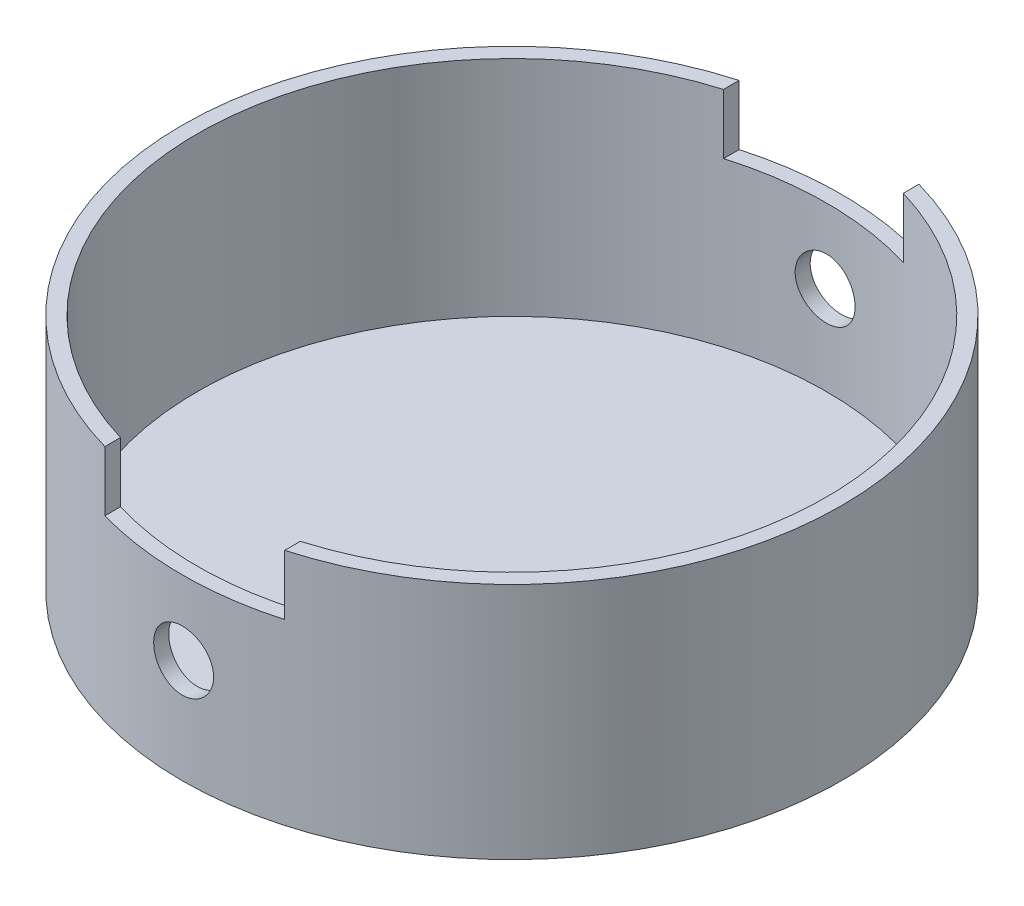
from build123d import *

# Parameters (mm, degrees)
SKETCH1_R           = 69.85
EXTRUDE1_DEPTH      = 50.4952
SHELL1_T            = -3.175
EXTRUDE2_DEPTH      = 111.940570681
EXTRUDE2_DEPTH_BACK = 111.940570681
SKETCH2_W           = 38.1
SKETCH2_H           = 12.7
EXTRUDE3_DEPTH      = 111.940570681
EXTRUDE3_DEPTH_BACK = 111.940570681
SKETCH3_R           = 6.35


with BuildPart() as part:
    # Sketch1 → Extrude1 (new body)
    with BuildSketch(Plane(origin=(0, 0, 0), x_dir=(1, 0, 0), z_dir=(0, 1, 0))):
        with Locations(Location((0, 0, 0), (0, 0, 270))):
            Circle(SKETCH1_R)
    extrude(amount=EXTRUDE1_DEPTH)

    # Shell1
    shell1_openings = [part.faces().sort_by_distance(p)[0] for p in [
        (0, 50.4952, 0),
    ]]
    offset(amount=SHELL1_T, openings=shell1_openings, kind=Kind.INTERSECTION)

    # Sketch2 → Extrude2 (cut, two sides: drawn at the far end of the back side and taken through both)
    with BuildSketch(Plane.XY.offset(-EXTRUDE2_DEPTH_BACK)):
        with Locations((0, 44.1452)):
            Rectangle(SKETCH2_W, SKETCH2_H)
    extrude(amount=EXTRUDE2_DEPTH + EXTRUDE2_DEPTH_BACK, mode=Mode.SUBTRACT)

    # Sketch3 → Extrude3 (cut, two sides: drawn at the far end of the back side and taken through both)
    with BuildSketch(Plane.XY.offset(-EXTRUDE3_DEPTH_BACK)):
        with Locations((0, 22.0726)):
            Circle(SKETCH3_R)
    extrude(amount=EXTRUDE3_DEPTH + EXTRUDE3_DEPTH_BACK, mode=Mode.SUBTRACT)


solid = part.part
